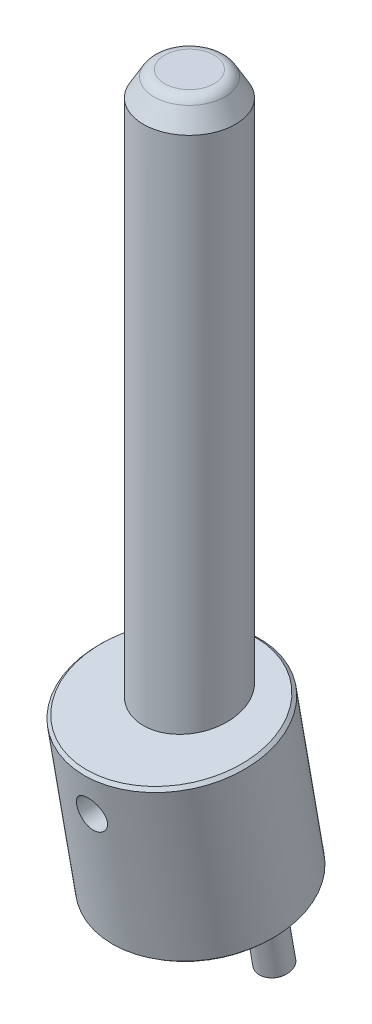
ISO-10303-21;
HEADER;
FILE_DESCRIPTION(('STEP AP214'),'2;1');
FILE_NAME('part.step','',(''),(''),'','','');
FILE_SCHEMA(('AUTOMOTIVE_DESIGN { 1 0 10303 214 1 1 1 1 }'));
ENDSEC;
DATA;
#1=APPLICATION_CONTEXT('core data for automotive mechanical design processes');
#2=APPLICATION_PROTOCOL_DEFINITION('international standard','automotive_design',2000,#1);
#3=PRODUCT_CONTEXT('',#1,'mechanical');
#4=PRODUCT('Part','Part','',(#3));
#5=PRODUCT_RELATED_PRODUCT_CATEGORY('part','',(#4));
#6=PRODUCT_DEFINITION_FORMATION('','',#4);
#7=PRODUCT_DEFINITION_CONTEXT('part definition',#1,'design');
#8=PRODUCT_DEFINITION('design','',#6,#7);
#9=PRODUCT_DEFINITION_SHAPE('','',#8);
#10=(LENGTH_UNIT() NAMED_UNIT(*) SI_UNIT(.MILLI.,.METRE.));
#11=(NAMED_UNIT(*) PLANE_ANGLE_UNIT() SI_UNIT($,.RADIAN.));
#12=(NAMED_UNIT(*) SI_UNIT($,.STERADIAN.) SOLID_ANGLE_UNIT());
#13=UNCERTAINTY_MEASURE_WITH_UNIT(LENGTH_MEASURE(1.E-05),#10,'distance_accuracy_value','');
#14=(GEOMETRIC_REPRESENTATION_CONTEXT(3) GLOBAL_UNCERTAINTY_ASSIGNED_CONTEXT((#13)) GLOBAL_UNIT_ASSIGNED_CONTEXT((#10,
#11,#12)) REPRESENTATION_CONTEXT('',''));
#15=CARTESIAN_POINT('',(0.,0.,0.));
#16=DIRECTION('',(0.,0.,1.));
#17=DIRECTION('',(1.,0.,0.));
#18=AXIS2_PLACEMENT_3D('',#15,#16,#17);
#19=CARTESIAN_POINT('',(0.,-24.9784317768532,-6.24652591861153));
#20=DIRECTION('',(0.,-0.984807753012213,-0.173648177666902));
#21=DIRECTION('',(0.,0.173648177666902,-0.984807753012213));
#22=AXIS2_PLACEMENT_3D('',#19,#20,#21);
#23=PLANE('',#22);
#24=CARTESIAN_POINT('',(-21.5,-24.9784317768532,-6.24652591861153));
#25=DIRECTION('',(0.,-0.984807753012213,-0.173648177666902));
#26=DIRECTION('',(0.,0.173648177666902,-0.984807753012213));
#27=AXIS2_PLACEMENT_3D('',#24,#25,#26);
#28=CIRCLE('',#27,4.50000075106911);
#29=CARTESIAN_POINT('',(-21.5,-24.1970148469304,-10.6781615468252));
#30=VERTEX_POINT('',#29);
#31=EDGE_CURVE('P0_E17',#30,#30,#28,.F.);
#32=ORIENTED_EDGE('',*,*,#31,.F.);
#33=EDGE_LOOP('',(#32));
#34=FACE_BOUND('',#33,.T.);
#35=ADVANCED_FACE('P0_F14',(#34),#23,.T.);
#36=CARTESIAN_POINT('',(0.,-24.9784317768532,-6.24652591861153));
#37=DIRECTION('',(0.,-0.984807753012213,-0.173648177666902));
#38=DIRECTION('',(0.,0.173648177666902,-0.984807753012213));
#39=AXIS2_PLACEMENT_3D('',#36,#37,#38);
#40=PLANE('',#39);
#41=CARTESIAN_POINT('',(21.5,-24.9784317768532,-6.24652591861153));
#42=DIRECTION('',(0.,-0.984807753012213,-0.173648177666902));
#43=DIRECTION('',(0.,0.173648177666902,-0.984807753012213));
#44=AXIS2_PLACEMENT_3D('',#41,#42,#43);
#45=CIRCLE('',#44,4.50000075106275);
#46=CARTESIAN_POINT('',(21.5,-24.1970148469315,-10.6781615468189));
#47=VERTEX_POINT('',#46);
#48=EDGE_CURVE('P0_E121',#47,#47,#45,.F.);
#49=ORIENTED_EDGE('',*,*,#48,.F.);
#50=EDGE_LOOP('',(#49));
#51=FACE_BOUND('',#50,.T.);
#52=ADVANCED_FACE('P0_F111',(#51),#40,.T.);
#53=CARTESIAN_POINT('',(0.,2.47891984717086E-12,-3.4781205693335E-13));
#54=DIRECTION('',(0.,-1.,0.));
#55=DIRECTION('',(0.,0.,-1.));
#56=AXIS2_PLACEMENT_3D('',#53,#54,#55);
#57=PLANE('',#56);
#58=CARTESIAN_POINT('',(0.,2.79984369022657E-12,-2.48629242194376E-12));
#59=DIRECTION('',(0.,-1.,0.));
#60=DIRECTION('',(0.,0.,-1.));
#61=AXIS2_PLACEMENT_3D('',#58,#59,#60);
#62=CIRCLE('',#61,15.);
#63=CARTESIAN_POINT('',(0.,2.79984369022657E-12,-15.0000000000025));
#64=VERTEX_POINT('',#63);
#65=EDGE_CURVE('P0_E36',#64,#64,#62,.F.);
#66=ORIENTED_EDGE('',*,*,#65,.T.);
#67=EDGE_LOOP('',(#66));
#68=FACE_BOUND('',#67,.T.);
#69=ADVANCED_FACE('P0_F108',(#68),#57,.F.);
#70=CARTESIAN_POINT('',(-21.5,-24.4860273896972,-6.15970173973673));
#71=DIRECTION('',(0.,0.984807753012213,0.173648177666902));
#72=DIRECTION('',(0.,-0.173648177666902,0.984807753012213));
#73=AXIS2_PLACEMENT_3D('',#70,#71,#72);
#74=CONICAL_SURFACE('',#73,5.00000135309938,0.785398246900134);
#75=CARTESIAN_POINT('',(-21.5,-24.4860260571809,-6.15970150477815));
#76=DIRECTION('',(0.,-0.984807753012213,-0.173648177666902));
#77=DIRECTION('',(0.,0.173648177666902,-0.984807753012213));
#78=AXIS2_PLACEMENT_3D('',#75,#76,#77);
#79=CIRCLE('',#78,5.);
#80=CARTESIAN_POINT('',(-21.5,-23.6177851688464,-11.0837402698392));
#81=VERTEX_POINT('',#80);
#82=EDGE_CURVE('P0_E33',#81,#81,#79,.F.);
#83=ORIENTED_EDGE('',*,*,#82,.F.);
#84=EDGE_LOOP('',(#83));
#85=FACE_BOUND('',#84,.T.);
#86=ORIENTED_EDGE('',*,*,#31,.T.);
#87=EDGE_LOOP('',(#86));
#88=FACE_BOUND('',#87,.T.);
#89=ADVANCED_FACE('P0_F104',(#85,#88),#74,.T.);
#90=CARTESIAN_POINT('',(21.5,-24.4860273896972,-6.15970173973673));
#91=DIRECTION('',(0.,0.984807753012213,0.173648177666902));
#92=DIRECTION('',(0.,-0.173648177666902,0.984807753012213));
#93=AXIS2_PLACEMENT_3D('',#90,#91,#92);
#94=CONICAL_SURFACE('',#93,5.00000135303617,0.785398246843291);
#95=CARTESIAN_POINT('',(21.5,-24.4860260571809,-6.15970150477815));
#96=DIRECTION('',(0.,-0.984807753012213,-0.173648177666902));
#97=DIRECTION('',(0.,0.173648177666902,-0.984807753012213));
#98=AXIS2_PLACEMENT_3D('',#95,#96,#97);
#99=CIRCLE('',#98,5.);
#100=CARTESIAN_POINT('',(21.5,-23.6177851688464,-11.0837402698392));
#101=VERTEX_POINT('',#100);
#102=EDGE_CURVE('P0_E29',#101,#101,#99,.F.);
#103=ORIENTED_EDGE('',*,*,#102,.F.);
#104=EDGE_LOOP('',(#103));
#105=FACE_BOUND('',#104,.T.);
#106=ORIENTED_EDGE('',*,*,#48,.T.);
#107=EDGE_LOOP('',(#106));
#108=FACE_BOUND('',#107,.T.);
#109=ADVANCED_FACE('P0_F99',(#105,#108),#94,.T.);
#110=CARTESIAN_POINT('',(0.,60.5716661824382,-2.48759346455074E-12));
#111=DIRECTION('',(0.,-1.,0.));
#112=DIRECTION('',(0.,0.,-1.));
#113=AXIS2_PLACEMENT_3D('',#110,#111,#112);
#114=CYLINDRICAL_SURFACE('',#113,15.);
#115=CARTESIAN_POINT('',(0.,45.0000000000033,-2.48759346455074E-12));
#116=DIRECTION('',(0.,0.984807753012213,0.173648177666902));
#117=DIRECTION('',(0.,-0.173648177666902,0.984807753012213));
#118=AXIS2_PLACEMENT_3D('',#115,#116,#117);
#119=ELLIPSE('',#118,15.2313991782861,15.);
#120=CARTESIAN_POINT('',(0.,42.3550952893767,14.9999999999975));
#121=VERTEX_POINT('',#120);
#122=EDGE_CURVE('P0_E32',#121,#121,#119,.F.);
#123=ORIENTED_EDGE('',*,*,#122,.F.);
#124=EDGE_LOOP('',(#123));
#125=FACE_BOUND('',#124,.T.);
#126=ORIENTED_EDGE('',*,*,#65,.F.);
#127=EDGE_LOOP('',(#126));
#128=FACE_BOUND('',#127,.T.);
#129=CARTESIAN_POINT('',(0.,31.0000000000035,14.9999999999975));
#130=CARTESIAN_POINT('',(-0.13627460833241,30.999999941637,14.999999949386));
#131=CARTESIAN_POINT('',(-0.272550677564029,30.9944241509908,14.9981386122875));
#132=CARTESIAN_POINT('',(-0.544142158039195,30.9721706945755,14.9907428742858));
#133=CARTESIAN_POINT('',(-0.679457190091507,30.9554888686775,14.985207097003));
#134=CARTESIAN_POINT('',(-0.948257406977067,30.9111491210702,14.9706027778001));
#135=CARTESIAN_POINT('',(-1.08174007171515,30.8834773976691,14.9615297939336));
#136=CARTESIAN_POINT('',(-1.34580155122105,30.8174009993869,14.9400929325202));
#137=CARTESIAN_POINT('',(-1.47637921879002,30.7789921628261,14.9277277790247));
#138=CARTESIAN_POINT('',(-1.7333461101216,30.6918928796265,14.9000723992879));
#139=CARTESIAN_POINT('',(-1.85974572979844,30.6432305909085,14.8847901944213));
#140=CARTESIAN_POINT('',(-2.10792399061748,30.5359631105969,14.8516789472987));
#141=CARTESIAN_POINT('',(-2.22970089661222,30.4773542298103,14.833848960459));
#142=CARTESIAN_POINT('',(-2.58680471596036,30.2873070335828,14.7772227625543));
#143=CARTESIAN_POINT('',(-2.81420620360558,30.1415453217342,14.7352562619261));
#144=CARTESIAN_POINT('',(-3.24874257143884,29.8108587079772,14.6457020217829));
#145=CARTESIAN_POINT('',(-3.45501840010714,29.6248491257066,14.5979792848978));
#146=CARTESIAN_POINT('',(-3.8341436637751,29.2211801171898,14.5030192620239));
#147=CARTESIAN_POINT('',(-4.0069839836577,29.0035120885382,14.4557821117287));
#148=CARTESIAN_POINT('',(-4.31912807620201,28.5350726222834,14.3656662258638));
#149=CARTESIAN_POINT('',(-4.45732572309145,28.2835298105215,14.3229516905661));
#150=CARTESIAN_POINT('',(-4.68909399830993,27.7591186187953,14.2487652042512));
#151=CARTESIAN_POINT('',(-4.78267844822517,27.4862568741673,14.217289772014));
#152=CARTESIAN_POINT('',(-4.91936749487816,26.9366338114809,14.1705651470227));
#153=CARTESIAN_POINT('',(-4.96406724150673,26.6603139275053,14.1548047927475));
#154=CARTESIAN_POINT('',(-5.00670561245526,26.1036813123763,14.1397828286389));
#155=CARTESIAN_POINT('',(-5.00465868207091,25.8233698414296,14.1405161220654));
#156=CARTESIAN_POINT('',(-4.95509941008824,25.2803173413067,14.1579507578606));
#157=CARTESIAN_POINT('',(-4.90966912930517,25.0173587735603,14.173920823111));
#158=CARTESIAN_POINT('',(-4.77803186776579,24.5030345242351,14.218832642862));
#159=CARTESIAN_POINT('',(-4.69181981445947,24.2516702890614,14.2477760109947));
#160=CARTESIAN_POINT('',(-4.47968995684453,23.7629279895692,14.3158968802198));
#161=CARTESIAN_POINT('',(-4.35315416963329,23.525840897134,14.3552319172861));
#162=CARTESIAN_POINT('',(-4.06444611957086,23.0756402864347,14.4396288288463));
#163=CARTESIAN_POINT('',(-3.90226546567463,22.8625324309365,14.4846920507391));
#164=CARTESIAN_POINT('',(-3.53674216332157,22.4545530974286,14.578364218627));
#165=CARTESIAN_POINT('',(-3.33169626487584,22.2612084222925,14.6270356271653));
#166=CARTESIAN_POINT('',(-3.00176707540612,21.9988448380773,14.6970107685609));
#167=CARTESIAN_POINT('',(-2.88796886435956,21.9159467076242,14.7198467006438));
#168=CARTESIAN_POINT('',(-2.65358317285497,21.759919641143,14.7638979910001));
#169=CARTESIAN_POINT('',(-2.53299841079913,21.6867868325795,14.7851139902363));
#170=CARTESIAN_POINT('',(-2.28442944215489,21.550086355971,14.8255663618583));
#171=CARTESIAN_POINT('',(-2.15637801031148,21.486633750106,14.8447781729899));
#172=CARTESIAN_POINT('',(-1.89503347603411,21.3708247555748,14.8803974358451));
#173=CARTESIAN_POINT('',(-1.76174256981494,21.3184637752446,14.8968060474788));
#174=CARTESIAN_POINT('',(-1.49104566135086,21.2253547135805,14.9263287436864));
#175=CARTESIAN_POINT('',(-1.3536464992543,21.1845884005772,14.9394479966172));
#176=CARTESIAN_POINT('',(-1.0756272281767,21.114966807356,14.9620340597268));
#177=CARTESIAN_POINT('',(-0.935008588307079,21.0861062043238,14.9715025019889));
#178=CARTESIAN_POINT('',(-0.662330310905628,21.0422867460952,14.9859443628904));
#179=CARTESIAN_POINT('',(-0.530427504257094,21.026441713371,14.9912035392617));
#180=CARTESIAN_POINT('',(-0.26568359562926,21.0052983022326,14.9982313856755));
#181=CARTESIAN_POINT('',(-0.132842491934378,20.999999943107,15.0000000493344));
#182=CARTESIAN_POINT('',(0.136274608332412,21.0000000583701,14.999999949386));
#183=CARTESIAN_POINT('',(0.27255067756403,21.0055758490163,14.9981386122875));
#184=CARTESIAN_POINT('',(0.544142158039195,21.0278293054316,14.9907428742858));
#185=CARTESIAN_POINT('',(0.679457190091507,21.0445111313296,14.985207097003));
#186=CARTESIAN_POINT('',(0.948257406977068,21.0888508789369,14.9706027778));
#187=CARTESIAN_POINT('',(1.08174007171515,21.116522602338,14.9615297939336));
#188=CARTESIAN_POINT('',(1.34580155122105,21.1825990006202,14.9400929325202));
#189=CARTESIAN_POINT('',(1.47637921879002,21.221007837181,14.9277277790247));
#190=CARTESIAN_POINT('',(1.7333461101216,21.3081071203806,14.9000723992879));
#191=CARTESIAN_POINT('',(1.85974572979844,21.3567694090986,14.8847901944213));
#192=CARTESIAN_POINT('',(2.10792399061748,21.4640368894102,14.8516789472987));
#193=CARTESIAN_POINT('',(2.22970089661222,21.5226457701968,14.833848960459));
#194=CARTESIAN_POINT('',(2.58680471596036,21.7126929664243,14.7772227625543));
#195=CARTESIAN_POINT('',(2.81420620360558,21.8584546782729,14.7352562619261));
#196=CARTESIAN_POINT('',(3.24874257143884,22.1891412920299,14.6457020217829));
#197=CARTESIAN_POINT('',(3.45501840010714,22.3751508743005,14.5979792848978));
#198=CARTESIAN_POINT('',(3.8341436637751,22.7788198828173,14.5030192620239));
#199=CARTESIAN_POINT('',(4.0069839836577,22.9964879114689,14.4557821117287));
#200=CARTESIAN_POINT('',(4.31912807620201,23.4649273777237,14.3656662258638));
#201=CARTESIAN_POINT('',(4.45732572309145,23.7164701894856,14.3229516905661));
#202=CARTESIAN_POINT('',(4.68909399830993,24.2408813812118,14.2487652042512));
#203=CARTESIAN_POINT('',(4.78267844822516,24.5137431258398,14.217289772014));
#204=CARTESIAN_POINT('',(4.91936749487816,25.0633661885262,14.1705651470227));
#205=CARTESIAN_POINT('',(4.96406724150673,25.3396860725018,14.1548047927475));
#206=CARTESIAN_POINT('',(5.00670561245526,25.8963186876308,14.1397828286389));
#207=CARTESIAN_POINT('',(5.0046586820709,26.1766301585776,14.1405161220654));
#208=CARTESIAN_POINT('',(4.95509941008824,26.7196826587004,14.1579507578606));
#209=CARTESIAN_POINT('',(4.90966912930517,26.9826412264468,14.173920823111));
#210=CARTESIAN_POINT('',(4.77803186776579,27.496965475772,14.218832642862));
#211=CARTESIAN_POINT('',(4.69181981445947,27.7483297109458,14.2477760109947));
#212=CARTESIAN_POINT('',(4.47968995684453,28.2370720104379,14.3158968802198));
#213=CARTESIAN_POINT('',(4.35315416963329,28.4741591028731,14.3552319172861));
#214=CARTESIAN_POINT('',(4.06444611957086,28.9243597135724,14.4396288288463));
#215=CARTESIAN_POINT('',(3.90226546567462,29.1374675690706,14.4846920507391));
#216=CARTESIAN_POINT('',(3.53674216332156,29.5454469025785,14.578364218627));
#217=CARTESIAN_POINT('',(3.33169626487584,29.7387915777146,14.6270356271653));
#218=CARTESIAN_POINT('',(3.00176707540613,30.0011551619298,14.6970107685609));
#219=CARTESIAN_POINT('',(2.88796886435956,30.0840532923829,14.7198467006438));
#220=CARTESIAN_POINT('',(2.65358317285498,30.2400803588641,14.7638979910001));
#221=CARTESIAN_POINT('',(2.53299841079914,30.3132131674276,14.7851139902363));
#222=CARTESIAN_POINT('',(2.2844294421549,30.4499136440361,14.8255663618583));
#223=CARTESIAN_POINT('',(2.15637801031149,30.5133662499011,14.8447781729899));
#224=CARTESIAN_POINT('',(1.89503347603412,30.6291752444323,14.8803974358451));
#225=CARTESIAN_POINT('',(1.76174256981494,30.6815362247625,14.8968060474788));
#226=CARTESIAN_POINT('',(1.49104566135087,30.7746452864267,14.9263287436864));
#227=CARTESIAN_POINT('',(1.3536464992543,30.8154115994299,14.9394479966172));
#228=CARTESIAN_POINT('',(1.0756272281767,30.8850331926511,14.9620340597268));
#229=CARTESIAN_POINT('',(0.935008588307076,30.9138937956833,14.9715025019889));
#230=CARTESIAN_POINT('',(0.662330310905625,30.9577132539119,14.9859443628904));
#231=CARTESIAN_POINT('',(0.530427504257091,30.9735582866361,14.9912035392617));
#232=CARTESIAN_POINT('',(0.265683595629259,30.9947016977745,14.9982313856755));
#233=CARTESIAN_POINT('',(0.132842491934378,31.0000000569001,15.0000000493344));
#234=CARTESIAN_POINT('',(0.,31.0000000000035,14.9999999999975));
#235=B_SPLINE_CURVE_WITH_KNOTS('',3,(#129,#130,#131,#132,#133,#134,#135,#136,#137,#138,#139,
#140,#141,#142,#143,#144,#145,#146,#147,#148,#149,#150,#151,#152,#153,#154,#155,#156,#157,#158,
#159,#160,#161,#162,#163,#164,#165,#166,#167,#168,#169,#170,#171,#172,#173,#174,#175,#176,#177,
#178,#179,#180,#181,#182,#183,#184,#185,#186,#187,#188,#189,#190,#191,#192,#193,#194,#195,#196,
#197,#198,#199,#200,#201,#202,#203,#204,#205,#206,#207,#208,#209,#210,#211,#212,#213,#214,#215,
#216,#217,#218,#219,#220,#221,#222,#223,#224,#225,#226,#227,#228,#229,#230,#231,#232,#233,#234),
.UNSPECIFIED.,.T.,.F.,(4,2,2,2,2,2,2,2,2,2,2,2,2,2,2,2,2,2,2,2,2,2,2,2,2,2,2,2,2,2,2,2,2,2,2,2,
2,2,2,2,2,2,2,2,2,2,2,2,2,2,2,2,4),(0.,0.408700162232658,0.817553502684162,1.22692193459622,
1.6364492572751,2.04486626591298,2.45343508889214,3.26962321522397,4.11140352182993,
4.95341299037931,5.81961254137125,6.68554356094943,7.52228757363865,8.35877302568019,
9.15703078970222,9.95538786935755,10.7666215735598,11.5780464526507,12.4317109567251,
12.8591940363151,13.286507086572,13.7185586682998,14.150431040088,14.5816205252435,
15.0126170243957,15.4110232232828,15.8094301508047,16.2181303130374,16.6269836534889,
17.0363520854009,17.4458794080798,17.8542964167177,18.2628652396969,19.0790533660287,
19.9208336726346,20.762843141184,21.629042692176,22.4949737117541,23.3317177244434,
24.1682031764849,24.9664609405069,25.7648180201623,26.5760517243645,27.3874766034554,
28.2411411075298,28.6686241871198,29.0959372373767,29.5279888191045,29.9598611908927,
30.3910506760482,30.8220471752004,31.2204533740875,31.6188603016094),.UNSPECIFIED.);
#236=CARTESIAN_POINT('',(0.,31.0000000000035,14.9999999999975));
#237=VERTEX_POINT('',#236);
#238=EDGE_CURVE('P0_E84',#237,#237,#235,.T.);
#239=ORIENTED_EDGE('',*,*,#238,.T.);
#240=EDGE_LOOP('',(#239));
#241=FACE_BOUND('',#240,.T.);
#242=ADVANCED_FACE('P0_F93',(#125,#128,#241),#114,.F.);
#243=CARTESIAN_POINT('',(-21.5,-10.20631548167,-3.641803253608));
#244=DIRECTION('',(0.,-0.984807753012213,-0.173648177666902));
#245=DIRECTION('',(0.,0.173648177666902,-0.984807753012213));
#246=AXIS2_PLACEMENT_3D('',#243,#244,#245);
#247=CYLINDRICAL_SURFACE('',#246,5.);
#248=CARTESIAN_POINT('',(-21.5,-10.20631548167,-3.641803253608));
#249=DIRECTION('',(0.,-0.984807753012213,-0.173648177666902));
#250=DIRECTION('',(0.,0.173648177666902,-0.984807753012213));
#251=AXIS2_PLACEMENT_3D('',#248,#249,#250);
#252=CIRCLE('',#251,5.);
#253=CARTESIAN_POINT('',(-21.5,-9.33807459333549,-8.56584201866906));
#254=VERTEX_POINT('',#253);
#255=EDGE_CURVE('P0_E80',#254,#254,#252,.T.);
#256=ORIENTED_EDGE('',*,*,#255,.T.);
#257=EDGE_LOOP('',(#256));
#258=FACE_BOUND('',#257,.T.);
#259=ORIENTED_EDGE('',*,*,#82,.T.);
#260=EDGE_LOOP('',(#259));
#261=FACE_BOUND('',#260,.T.);
#262=ADVANCED_FACE('P0_F98',(#258,#261),#247,.T.);
#263=CARTESIAN_POINT('',(21.5,-10.20631548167,-3.641803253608));
#264=DIRECTION('',(0.,-0.984807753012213,-0.173648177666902));
#265=DIRECTION('',(0.,0.173648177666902,-0.984807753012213));
#266=AXIS2_PLACEMENT_3D('',#263,#264,#265);
#267=CYLINDRICAL_SURFACE('',#266,5.);
#268=CARTESIAN_POINT('',(21.5,-10.20631548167,-3.641803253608));
#269=DIRECTION('',(0.,-0.984807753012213,-0.173648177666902));
#270=DIRECTION('',(0.,0.173648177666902,-0.984807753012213));
#271=AXIS2_PLACEMENT_3D('',#268,#269,#270);
#272=CIRCLE('',#271,5.);
#273=CARTESIAN_POINT('',(21.5,-9.33807459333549,-8.56584201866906));
#274=VERTEX_POINT('',#273);
#275=EDGE_CURVE('P0_E76',#274,#274,#272,.T.);
#276=ORIENTED_EDGE('',*,*,#275,.T.);
#277=EDGE_LOOP('',(#276));
#278=FACE_BOUND('',#277,.T.);
#279=ORIENTED_EDGE('',*,*,#102,.T.);
#280=EDGE_LOOP('',(#279));
#281=FACE_BOUND('',#280,.T.);
#282=ADVANCED_FACE('P0_F178',(#278,#281),#267,.T.);
#283=CARTESIAN_POINT('',(0.,43.9581109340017,5.90884651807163));
#284=DIRECTION('',(0.,0.984807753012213,0.173648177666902));
#285=DIRECTION('',(0.,-0.173648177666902,0.984807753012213));
#286=AXIS2_PLACEMENT_3D('',#283,#284,#285);
#287=PLANE('',#286);
#288=ORIENTED_EDGE('',*,*,#122,.T.);
#289=EDGE_LOOP('',(#288));
#290=FACE_BOUND('',#289,.T.);
#291=CARTESIAN_POINT('',(0.,43.9581109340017,5.9088465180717));
#292=DIRECTION('',(0.,0.984807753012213,0.173648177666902));
#293=DIRECTION('',(0.,-0.173648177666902,0.984807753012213));
#294=AXIS2_PLACEMENT_3D('',#291,#292,#293);
#295=CIRCLE('',#294,27.9999945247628);
#296=CARTESIAN_POINT('',(0.,39.0959629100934,33.4834582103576));
#297=VERTEX_POINT('',#296);
#298=EDGE_CURVE('P0_E46',#297,#297,#295,.F.);
#299=ORIENTED_EDGE('',*,*,#298,.F.);
#300=EDGE_LOOP('',(#299));
#301=FACE_BOUND('',#300,.T.);
#302=ADVANCED_FACE('P0_F71',(#290,#301),#287,.T.);
#303=CARTESIAN_POINT('',(0.,26.0000000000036,-5.5138031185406));
#304=DIRECTION('',(0.,0.,1.));
#305=DIRECTION('',(0.,-1.,0.));
#306=AXIS2_PLACEMENT_3D('',#303,#304,#305);
#307=CYLINDRICAL_SURFACE('',#306,5.);
#308=ORIENTED_EDGE('',*,*,#238,.F.);
#309=EDGE_LOOP('',(#308));
#310=FACE_BOUND('',#309,.T.);
#311=CARTESIAN_POINT('',(0.,21.0000000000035,31.3080838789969));
#312=CARTESIAN_POINT('',(-0.140354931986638,21.0000005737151,31.3080837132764));
#313=CARTESIAN_POINT('',(-0.280725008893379,21.0059142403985,31.3080894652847));
#314=CARTESIAN_POINT('',(-0.560523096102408,21.0295335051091,31.308133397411));
#315=CARTESIAN_POINT('',(-0.69995066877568,21.0472442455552,31.3081715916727));
#316=CARTESIAN_POINT('',(-0.97703493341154,21.0943725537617,31.3083440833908));
#317=CARTESIAN_POINT('',(-1.1146885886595,21.1238079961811,31.3084785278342));
#318=CARTESIAN_POINT('',(-1.38707525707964,21.1941892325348,31.3089475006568));
#319=CARTESIAN_POINT('',(-1.52180715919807,21.2351393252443,31.3092821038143));
#320=CARTESIAN_POINT('',(-1.78719418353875,21.3282028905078,31.3102916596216));
#321=CARTESIAN_POINT('',(-1.91785354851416,21.3803042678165,31.3109662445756));
#322=CARTESIAN_POINT('',(-2.17436447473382,21.4953463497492,31.3128281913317));
#323=CARTESIAN_POINT('',(-2.30021424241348,21.5582910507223,31.3140157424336));
#324=CARTESIAN_POINT('',(-2.54605968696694,21.6945020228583,31.3171010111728));
#325=CARTESIAN_POINT('',(-2.66605989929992,21.7677601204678,31.3189981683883));
#326=CARTESIAN_POINT('',(-2.89949840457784,21.9241377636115,31.3237207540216));
#327=CARTESIAN_POINT('',(-3.01293426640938,22.0072609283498,31.3265465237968));
#328=CARTESIAN_POINT('',(-3.23222119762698,22.1826153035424,31.3333495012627));
#329=CARTESIAN_POINT('',(-3.33808323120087,22.2748328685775,31.3373250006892));
#330=CARTESIAN_POINT('',(-3.54168749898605,22.4678429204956,31.3466603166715));
#331=CARTESIAN_POINT('',(-3.63942671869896,22.5686385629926,31.3520206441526));
#332=CARTESIAN_POINT('',(-3.82601073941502,22.7779981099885,31.3643452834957));
#333=CARTESIAN_POINT('',(-3.91485858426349,22.8865593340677,31.3713090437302));
#334=CARTESIAN_POINT('',(-4.08309789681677,23.1107169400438,31.3870496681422));
#335=CARTESIAN_POINT('',(-4.1624858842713,23.2263158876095,31.3958271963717));
#336=CARTESIAN_POINT('',(-4.31079436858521,23.4629852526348,31.4153180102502));
#337=CARTESIAN_POINT('',(-4.37977090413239,23.5840214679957,31.4260201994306));
#338=CARTESIAN_POINT('',(-4.50734130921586,23.8313044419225,31.4495370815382));
#339=CARTESIAN_POINT('',(-4.56593136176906,23.9575530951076,31.4623525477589));
#340=CARTESIAN_POINT('',(-4.67229502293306,24.2142393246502,31.4901881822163));
#341=CARTESIAN_POINT('',(-4.72007314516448,24.3446751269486,31.5052074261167));
#342=CARTESIAN_POINT('',(-4.80457028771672,24.6088240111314,31.5374990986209));
#343=CARTESIAN_POINT('',(-4.84128520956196,24.7425382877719,31.5547723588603));
#344=CARTESIAN_POINT('',(-4.9344018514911,25.1468196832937,31.6099488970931));
#345=CARTESIAN_POINT('',(-4.97397498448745,25.4210095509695,31.6512604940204));
#346=CARTESIAN_POINT('',(-5.00750238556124,25.9706241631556,31.7422229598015));
#347=CARTESIAN_POINT('',(-5.00145259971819,26.24604901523,31.7918745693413));
#348=CARTESIAN_POINT('',(-4.94414664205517,26.7956211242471,31.8989076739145));
#349=CARTESIAN_POINT('',(-4.89211286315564,27.0696644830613,31.9564076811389));
#350=CARTESIAN_POINT('',(-4.74372153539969,27.6044139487,32.0760821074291));
#351=CARTESIAN_POINT('',(-4.64735533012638,27.8651174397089,32.138257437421));
#352=CARTESIAN_POINT('',(-4.40964293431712,28.3740866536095,32.2661774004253));
#353=CARTESIAN_POINT('',(-4.26705267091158,28.6217578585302,32.3319732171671));
#354=CARTESIAN_POINT('',(-3.94143600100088,29.0896967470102,32.4617479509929));
#355=CARTESIAN_POINT('',(-3.75840730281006,29.3099628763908,32.5257267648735));
#356=CARTESIAN_POINT('',(-3.45620879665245,29.6160125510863,32.6176239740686));
#357=CARTESIAN_POINT('',(-3.35020903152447,29.714441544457,32.647731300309));
#358=CARTESIAN_POINT('',(-3.12977546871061,29.9019749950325,32.7059630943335));
#359=CARTESIAN_POINT('',(-3.0153450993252,29.991083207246,32.7340883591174));
#360=CARTESIAN_POINT('',(-2.77869820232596,30.1593193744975,32.7878790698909));
#361=CARTESIAN_POINT('',(-2.65647588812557,30.2384397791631,32.8135426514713));
#362=CARTESIAN_POINT('',(-2.40520446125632,30.3859090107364,32.861897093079));
#363=CARTESIAN_POINT('',(-2.27615845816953,30.4542626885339,32.8845892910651));
#364=CARTESIAN_POINT('',(-2.01626980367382,30.5776297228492,32.925907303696));
#365=CARTESIAN_POINT('',(-1.88561064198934,30.6329944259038,32.9446383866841));
#366=CARTESIAN_POINT('',(-1.61970463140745,30.732514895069,32.9785342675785));
#367=CARTESIAN_POINT('',(-1.48445990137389,30.7766757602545,32.9937006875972));
#368=CARTESIAN_POINT('',(-1.21062826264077,30.8533034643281,33.0201453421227));
#369=CARTESIAN_POINT('',(-1.07204874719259,30.8857940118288,33.0314314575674));
#370=CARTESIAN_POINT('',(-0.792421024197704,30.9388562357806,33.0499192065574));
#371=CARTESIAN_POINT('',(-0.651374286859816,30.9594347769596,33.0571231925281));
#372=CARTESIAN_POINT('',(-0.425043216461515,30.9826278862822,33.0652531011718));
#373=CARTESIAN_POINT('',(-0.340186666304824,30.9891396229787,33.067539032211));
#374=CARTESIAN_POINT('',(-0.170223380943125,30.9978259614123,33.0705894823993));
#375=CARTESIAN_POINT('',(-0.0851166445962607,31.0000005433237,33.0713539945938));
#376=CARTESIAN_POINT('',(0.135219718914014,30.9999991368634,33.0713531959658));
#377=CARTESIAN_POINT('',(0.270464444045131,30.9945087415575,33.069422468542));
#378=CARTESIAN_POINT('',(0.540009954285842,30.972593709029,33.0617338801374));
#379=CARTESIAN_POINT('',(0.674310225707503,30.9561635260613,33.0559740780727));
#380=CARTESIAN_POINT('',(0.941162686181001,30.9124861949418,33.040723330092));
#381=CARTESIAN_POINT('',(1.07371151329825,30.8852206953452,33.0312260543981));
#382=CARTESIAN_POINT('',(1.33592795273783,30.8201199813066,33.0086759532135));
#383=CARTESIAN_POINT('',(1.46559441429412,30.7822806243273,32.9956217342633));
#384=CARTESIAN_POINT('',(1.72075531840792,30.6964943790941,32.9662378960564));
#385=CARTESIAN_POINT('',(1.84626038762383,30.6485759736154,32.9499175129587));
#386=CARTESIAN_POINT('',(2.09267219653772,30.5429859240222,32.9142684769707));
#387=CARTESIAN_POINT('',(2.21357721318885,30.4853106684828,32.8949387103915));
#388=CARTESIAN_POINT('',(2.5680548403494,30.2984045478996,32.8329409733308));
#389=CARTESIAN_POINT('',(2.79373594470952,30.1551761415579,32.7862235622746));
#390=CARTESIAN_POINT('',(3.22468958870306,29.8309759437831,32.6834595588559));
#391=CARTESIAN_POINT('',(3.4291385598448,29.6489937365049,32.6271735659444));
#392=CARTESIAN_POINT('',(3.80514153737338,29.2550044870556,32.5097073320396));
#393=CARTESIAN_POINT('',(3.9766852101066,29.0429880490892,32.448525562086));
#394=CARTESIAN_POINT('',(4.290166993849,28.583673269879,32.3217414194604));
#395=CARTESIAN_POINT('',(4.43033462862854,28.3351849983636,32.2560664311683));
#396=CARTESIAN_POINT('',(4.66662569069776,27.8175626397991,32.126693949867));
#397=CARTESIAN_POINT('',(4.7627448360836,27.5484265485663,32.0629966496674));
#398=CARTESIAN_POINT('',(4.90883098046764,26.9933510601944,31.9400388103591));
#399=CARTESIAN_POINT('',(4.95823701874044,26.7072502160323,31.8808398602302));
#400=CARTESIAN_POINT('',(5.00672423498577,26.1291392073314,31.7703203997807));
#401=CARTESIAN_POINT('',(5.0058132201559,25.8371299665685,31.7189986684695));
#402=CARTESIAN_POINT('',(4.9665482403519,25.405230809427,31.6497846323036));
#403=CARTESIAN_POINT('',(4.94758189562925,25.2639201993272,31.6282192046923));
#404=CARTESIAN_POINT('',(4.89757632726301,24.9831224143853,31.5874543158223));
#405=CARTESIAN_POINT('',(4.86654205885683,24.8436345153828,31.5682538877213));
#406=CARTESIAN_POINT('',(4.7925384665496,24.5675117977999,31.5322571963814));
#407=CARTESIAN_POINT('',(4.74956581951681,24.4308777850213,31.5154616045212));
#408=CARTESIAN_POINT('',(4.65196992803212,24.1616120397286,31.4842619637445));
#409=CARTESIAN_POINT('',(4.59735134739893,24.028978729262,31.4698569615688));
#410=CARTESIAN_POINT('',(4.47836930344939,23.7720561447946,31.4436921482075));
#411=CARTESIAN_POINT('',(4.41429231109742,23.6476400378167,31.4318738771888));
#412=CARTESIAN_POINT('',(4.2758737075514,23.4045306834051,31.4103066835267));
#413=CARTESIAN_POINT('',(4.20153612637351,23.2858352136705,31.4005569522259));
#414=CARTESIAN_POINT('',(4.04307170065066,23.0549738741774,31.3829574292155));
#415=CARTESIAN_POINT('',(3.9589422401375,22.9428097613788,31.3751081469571));
#416=CARTESIAN_POINT('',(3.78153658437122,22.7259196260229,31.3611225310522));
#417=CARTESIAN_POINT('',(3.68826376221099,22.6211908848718,31.3549855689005));
#418=CARTESIAN_POINT('',(3.49382094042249,22.4205291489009,31.3442399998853));
#419=CARTESIAN_POINT('',(3.39270402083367,22.3245452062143,31.3396220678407));
#420=CARTESIAN_POINT('',(3.18282015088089,22.1413668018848,31.3316411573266));
#421=CARTESIAN_POINT('',(3.0740560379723,22.0541691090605,31.3282777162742));
#422=CARTESIAN_POINT('',(2.84952119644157,21.8890801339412,31.3225763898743));
#423=CARTESIAN_POINT('',(2.73374492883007,21.8111963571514,31.3202393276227));
#424=CARTESIAN_POINT('',(2.49612317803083,21.6653958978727,31.3163764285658));
#425=CARTESIAN_POINT('',(2.37427989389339,21.5974756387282,31.3148503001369));
#426=CARTESIAN_POINT('',(2.12458452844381,21.4716666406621,31.3123962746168));
#427=CARTESIAN_POINT('',(1.99670044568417,21.4138413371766,31.311472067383));
#428=CARTESIAN_POINT('',(1.73657081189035,21.3091609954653,31.3100511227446));
#429=CARTESIAN_POINT('',(1.60432688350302,21.2623019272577,31.3095542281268));
#430=CARTESIAN_POINT('',(1.33657346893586,21.1799208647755,31.3088309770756));
#431=CARTESIAN_POINT('',(1.20106920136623,21.1443819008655,31.3086042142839));
#432=CARTESIAN_POINT('',(0.927608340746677,21.0848079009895,31.3082972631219));
#433=CARTESIAN_POINT('',(0.789652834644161,21.0607678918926,31.3082170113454));
#434=CARTESIAN_POINT('',(0.543067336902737,21.0283884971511,31.3081298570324));
#435=CARTESIAN_POINT('',(0.434733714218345,21.0177471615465,31.3081106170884));
#436=CARTESIAN_POINT('',(0.217603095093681,21.0035526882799,31.3080876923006));
#437=CARTESIAN_POINT('',(0.108806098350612,20.9999995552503,31.3080840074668));
#438=CARTESIAN_POINT('',(0.,21.0000000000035,31.3080838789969));
#439=B_SPLINE_CURVE_WITH_KNOTS('',3,(#311,#312,#313,#314,#315,#316,#317,#318,#319,#320,#321,
#322,#323,#324,#325,#326,#327,#328,#329,#330,#331,#332,#333,#334,#335,#336,#337,#338,#339,#340,
#341,#342,#343,#344,#345,#346,#347,#348,#349,#350,#351,#352,#353,#354,#355,#356,#357,#358,#359,
#360,#361,#362,#363,#364,#365,#366,#367,#368,#369,#370,#371,#372,#373,#374,#375,#376,#377,#378,
#379,#380,#381,#382,#383,#384,#385,#386,#387,#388,#389,#390,#391,#392,#393,#394,#395,#396,#397,
#398,#399,#400,#401,#402,#403,#404,#405,#406,#407,#408,#409,#410,#411,#412,#413,#414,#415,#416,
#417,#418,#419,#420,#421,#422,#423,#424,#425,#426,#427,#428,#429,#430,#431,#432,#433,#434,#435,
#436,#437,#438),.UNSPECIFIED.,.T.,.F.,(4,2,2,2,2,2,2,2,2,2,2,2,2,2,2,2,2,2,2,2,2,2,2,2,2,2,2,2,
2,2,2,2,2,2,2,2,2,2,2,2,2,2,2,2,2,2,2,2,2,2,2,2,2,2,2,2,2,2,2,2,2,2,2,4),(0.,0.420966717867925,
0.84211705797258,1.26391192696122,1.68586447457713,2.1073616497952,2.52901450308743,
2.95033505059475,3.37181064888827,3.79266320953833,4.21367126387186,4.63453469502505,
5.05555248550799,5.47421651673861,5.89303408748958,6.31167649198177,6.73047379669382,
7.56650953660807,8.40261956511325,9.25314500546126,10.1038365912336,10.9796457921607,
11.8555046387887,12.2983095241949,12.7409353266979,13.1838937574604,13.626652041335,
14.0555148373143,14.4841820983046,14.9119735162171,15.3395181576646,15.5948156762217,
15.8501143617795,16.2556921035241,16.6614756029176,17.0679493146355,17.4745824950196,
17.8800816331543,18.2857311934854,19.0959410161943,19.9306524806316,20.765625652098,
21.6398439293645,22.5141471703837,23.3988210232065,24.283357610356,24.7155182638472,
25.1475016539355,25.5796054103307,26.0115364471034,26.4323684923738,26.8530357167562,
27.2738155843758,27.6944408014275,28.1124334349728,28.5302717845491,28.9484446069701,
29.3664669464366,29.7870282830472,30.2074348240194,30.6272081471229,31.0467997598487,
31.3731418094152,31.6994840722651),.UNSPECIFIED.);
#440=CARTESIAN_POINT('',(0.,21.0000000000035,31.3080838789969));
#441=VERTEX_POINT('',#440);
#442=EDGE_CURVE('P0_E39',#441,#441,#439,.T.);
#443=ORIENTED_EDGE('',*,*,#442,.F.);
#444=EDGE_LOOP('',(#443));
#445=FACE_BOUND('',#444,.T.);
#446=ADVANCED_FACE('P0_F48',(#310,#445),#307,.F.);
#447=CARTESIAN_POINT('',(0.,-10.20631548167,-3.641803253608));
#448=DIRECTION('',(0.,0.984807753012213,0.173648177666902));
#449=DIRECTION('',(0.,-0.173648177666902,0.984807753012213));
#450=AXIS2_PLACEMENT_3D('',#447,#448,#449);
#451=PLANE('',#450);
#452=ORIENTED_EDGE('',*,*,#275,.F.);
#453=EDGE_LOOP('',(#452));
#454=FACE_BOUND('',#453,.T.);
#455=ORIENTED_EDGE('',*,*,#255,.F.);
#456=EDGE_LOOP('',(#455));
#457=FACE_BOUND('',#456,.T.);
#458=CARTESIAN_POINT('',(-1.28369537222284E-13,-10.20631548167,-3.64180325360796));
#459=DIRECTION('',(0.,0.984807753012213,0.173648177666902));
#460=DIRECTION('',(0.,-0.173648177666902,0.984807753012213));
#461=AXIS2_PLACEMENT_3D('',#458,#459,#460);
#462=CIRCLE('',#461,27.9999942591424);
#463=CARTESIAN_POINT('',(-1.28369537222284E-13,-15.0684634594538,23.9328081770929));
#464=VERTEX_POINT('',#463);
#465=EDGE_CURVE('P0_E26',#464,#464,#462,.T.);
#466=ORIENTED_EDGE('',*,*,#465,.F.);
#467=EDGE_LOOP('',(#466));
#468=FACE_BOUND('',#467,.T.);
#469=ADVANCED_FACE('P0_F63',(#454,#457,#468),#451,.F.);
#470=CARTESIAN_POINT('',(0.,42.9733002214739,5.73519781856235));
#471=DIRECTION('',(0.,-0.984807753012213,-0.173648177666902));
#472=DIRECTION('',(0.,0.173648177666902,-0.984807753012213));
#473=AXIS2_PLACEMENT_3D('',#470,#471,#472);
#474=CONICAL_SURFACE('',#473,28.9999973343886,0.785398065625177);
#475=ORIENTED_EDGE('',*,*,#298,.T.);
#476=EDGE_LOOP('',(#475));
#477=FACE_BOUND('',#476,.T.);
#478=CARTESIAN_POINT('',(0.,42.9733028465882,5.73519828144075));
#479=DIRECTION('',(0.,0.984807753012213,0.173648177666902));
#480=DIRECTION('',(0.,-0.173648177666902,0.984807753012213));
#481=AXIS2_PLACEMENT_3D('',#478,#479,#480);
#482=CIRCLE('',#481,29.);
#483=CARTESIAN_POINT('',(0.,37.937505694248,34.2946231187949));
#484=VERTEX_POINT('',#483);
#485=EDGE_CURVE('P0_E21',#484,#484,#482,.F.);
#486=ORIENTED_EDGE('',*,*,#485,.F.);
#487=EDGE_LOOP('',(#486));
#488=FACE_BOUND('',#487,.T.);
#489=ADVANCED_FACE('P0_F60',(#477,#488),#474,.T.);
#490=CARTESIAN_POINT('',(-1.28369537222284E-13,-9.22150459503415,-3.46815452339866));
#491=DIRECTION('',(0.,0.984807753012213,0.173648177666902));
#492=DIRECTION('',(0.,-0.173648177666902,0.984807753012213));
#493=AXIS2_PLACEMENT_3D('',#490,#491,#492);
#494=CONICAL_SURFACE('',#493,28.9999972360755,0.785398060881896);
#495=CARTESIAN_POINT('',(0.,-9.22150731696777,-3.46815500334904));
#496=DIRECTION('',(0.,0.984807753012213,0.173648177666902));
#497=DIRECTION('',(0.,-0.173648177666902,0.984807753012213));
#498=AXIS2_PLACEMENT_3D('',#495,#496,#497);
#499=CIRCLE('',#498,29.);
#500=CARTESIAN_POINT('',(0.,-14.2573044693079,25.0912698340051));
#501=VERTEX_POINT('',#500);
#502=EDGE_CURVE('P0_E9',#501,#501,#499,.T.);
#503=ORIENTED_EDGE('',*,*,#502,.F.);
#504=EDGE_LOOP('',(#503));
#505=FACE_BOUND('',#504,.T.);
#506=ORIENTED_EDGE('',*,*,#465,.T.);
#507=EDGE_LOOP('',(#506));
#508=FACE_BOUND('',#507,.T.);
#509=ADVANCED_FACE('P0_F56',(#505,#508),#494,.T.);
#510=CARTESIAN_POINT('',(0.,-12.9145368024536,-4.11933574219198));
#511=DIRECTION('',(0.,0.984807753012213,0.173648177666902));
#512=DIRECTION('',(0.,-0.173648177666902,0.984807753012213));
#513=AXIS2_PLACEMENT_3D('',#510,#511,#512);
#514=CYLINDRICAL_SURFACE('',#513,29.);
#515=ORIENTED_EDGE('',*,*,#485,.T.);
#516=EDGE_LOOP('',(#515));
#517=FACE_BOUND('',#516,.T.);
#518=ORIENTED_EDGE('',*,*,#502,.T.);
#519=EDGE_LOOP('',(#518));
#520=FACE_BOUND('',#519,.T.);
#521=ORIENTED_EDGE('',*,*,#442,.T.);
#522=EDGE_LOOP('',(#521));
#523=FACE_BOUND('',#522,.T.);
#524=ADVANCED_FACE('P0_F52',(#517,#520,#523),#514,.T.);
#525=CLOSED_SHELL('',(#35,#52,#69,#89,#109,#242,#262,#282,#302,#446,#469,#489,#509,#524));
#526=MANIFOLD_SOLID_BREP('P0_B1',#525);
#527=CARTESIAN_POINT('',(0.,220.,0.));
#528=DIRECTION('',(0.,1.,0.));
#529=DIRECTION('',(-1.,0.,0.));
#530=AXIS2_PLACEMENT_3D('',#527,#528,#529);
#531=PLANE('',#530);
#532=CARTESIAN_POINT('',(0.,220.,0.));
#533=DIRECTION('',(0.,-1.,0.));
#534=DIRECTION('',(0.,0.,-1.));
#535=AXIS2_PLACEMENT_3D('',#532,#533,#534);
#536=CIRCLE('',#535,8.071796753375);
#537=CARTESIAN_POINT('',(0.,220.,-8.0717967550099));
#538=VERTEX_POINT('',#537);
#539=CARTESIAN_POINT('',(0.,220.,8.0717967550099));
#540=VERTEX_POINT('',#539);
#541=EDGE_CURVE('P1_E38',#538,#540,#536,.T.);
#542=ORIENTED_EDGE('',*,*,#541,.F.);
#543=CARTESIAN_POINT('',(0.,220.,0.));
#544=DIRECTION('',(0.,-1.,0.));
#545=DIRECTION('',(0.,0.,1.));
#546=AXIS2_PLACEMENT_3D('',#543,#544,#545);
#547=CIRCLE('',#546,8.071796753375);
#548=EDGE_CURVE('P1_E42',#540,#538,#547,.T.);
#549=ORIENTED_EDGE('',*,*,#548,.F.);
#550=EDGE_LOOP('',(#542,#549));
#551=FACE_BOUND('',#550,.T.);
#552=ADVANCED_FACE('P1_F17',(#551),#531,.T.);
#553=CARTESIAN_POINT('',(0.,216.,0.));
#554=DIRECTION('',(0.,1.,0.));
#555=DIRECTION('',(0.0058252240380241,0.,0.999983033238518));
#556=AXIS2_PLACEMENT_3D('',#553,#554,#555);
#557=TOROIDAL_SURFACE('',#556,8.071796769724,4.);
#558=ORIENTED_EDGE('',*,*,#541,.T.);
#559=ORIENTED_EDGE('',*,*,#548,.T.);
#560=EDGE_LOOP('',(#558,#559));
#561=FACE_BOUND('',#560,.T.);
#562=CARTESIAN_POINT('',(0.,218.000000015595,0.));
#563=DIRECTION('',(0.,-1.,0.));
#564=DIRECTION('',(0.,0.,1.));
#565=AXIS2_PLACEMENT_3D('',#562,#563,#564);
#566=CIRCLE('',#565,11.5358983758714);
#567=CARTESIAN_POINT('',(0.,218.000000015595,11.5358983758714));
#568=VERTEX_POINT('',#567);
#569=EDGE_CURVE('P1_E48',#568,#568,#566,.T.);
#570=ORIENTED_EDGE('',*,*,#569,.F.);
#571=EDGE_LOOP('',(#570));
#572=FACE_BOUND('',#571,.T.);
#573=ADVANCED_FACE('P1_F40',(#561,#572),#557,.T.);
#574=CARTESIAN_POINT('',(0.,0.,0.));
#575=DIRECTION('',(0.,1.,0.));
#576=DIRECTION('',(-1.,0.,0.));
#577=AXIS2_PLACEMENT_3D('',#574,#575,#576);
#578=PLANE('',#577);
#579=CARTESIAN_POINT('',(0.,0.,0.));
#580=DIRECTION('',(0.,1.,0.));
#581=DIRECTION('',(-1.,0.,0.));
#582=AXIS2_PLACEMENT_3D('',#579,#580,#581);
#583=CIRCLE('',#582,13.9999969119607);
#584=CARTESIAN_POINT('',(-13.9999969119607,0.,0.));
#585=VERTEX_POINT('',#584);
#586=EDGE_CURVE('P1_E85',#585,#585,#583,.T.);
#587=ORIENTED_EDGE('',*,*,#586,.F.);
#588=EDGE_LOOP('',(#587));
#589=FACE_BOUND('',#588,.T.);
#590=ADVANCED_FACE('P1_F76',(#589),#578,.F.);
#591=CARTESIAN_POINT('',(0.,26.,4.88675134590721));
#592=DIRECTION('',(0.,0.,1.));
#593=DIRECTION('',(0.,-1.,0.));
#594=AXIS2_PLACEMENT_3D('',#591,#592,#593);
#595=CONICAL_SURFACE('',#594,4.99999999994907,1.04719755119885);
#596=CARTESIAN_POINT('',(0.,26.0000000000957,1.99999999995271));
#597=VERTEX_POINT('',#596);
#598=VERTEX_LOOP('',#597);
#599=FACE_BOUND('',#598,.T.);
#600=CARTESIAN_POINT('',(0.,26.,4.886751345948));
#601=DIRECTION('',(0.,0.,1.));
#602=DIRECTION('',(0.,-1.,0.));
#603=AXIS2_PLACEMENT_3D('',#600,#601,#602);
#604=CIRCLE('',#603,5.);
#605=CARTESIAN_POINT('',(0.,21.,4.886751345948));
#606=VERTEX_POINT('',#605);
#607=EDGE_CURVE('P1_E82',#606,#606,#604,.T.);
#608=ORIENTED_EDGE('',*,*,#607,.T.);
#609=EDGE_LOOP('',(#608));
#610=FACE_BOUND('',#609,.T.);
#611=ADVANCED_FACE('P1_F116',(#599,#610),#595,.F.);
#612=CARTESIAN_POINT('',(0.,212.000000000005,0.));
#613=DIRECTION('',(0.,-1.,0.));
#614=DIRECTION('',(1.,0.,0.));
#615=AXIS2_PLACEMENT_3D('',#612,#613,#614);
#616=CONICAL_SURFACE('',#615,15.0000000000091,0.5235987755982);
#617=CARTESIAN_POINT('',(0.,212.,0.));
#618=DIRECTION('',(0.,1.,0.));
#619=DIRECTION('',(-1.,0.,0.));
#620=AXIS2_PLACEMENT_3D('',#617,#618,#619);
#621=CIRCLE('',#620,15.);
#622=CARTESIAN_POINT('',(-15.,212.,0.));
#623=VERTEX_POINT('',#622);
#624=EDGE_CURVE('P1_E92',#623,#623,#621,.F.);
#625=ORIENTED_EDGE('',*,*,#624,.F.);
#626=EDGE_LOOP('',(#625));
#627=FACE_BOUND('',#626,.T.);
#628=ORIENTED_EDGE('',*,*,#569,.T.);
#629=EDGE_LOOP('',(#628));
#630=FACE_BOUND('',#629,.T.);
#631=ADVANCED_FACE('P1_F108',(#627,#630),#616,.T.);
#632=CARTESIAN_POINT('',(0.,1.00000179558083,0.));
#633=DIRECTION('',(0.,1.,0.));
#634=DIRECTION('',(-1.,0.,0.));
#635=AXIS2_PLACEMENT_3D('',#632,#633,#634);
#636=CONICAL_SURFACE('',#635,14.9999984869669,0.785398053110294);
#637=CARTESIAN_POINT('',(0.,1.000000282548,0.));
#638=DIRECTION('',(0.,1.,0.));
#639=DIRECTION('',(-1.,0.,0.));
#640=AXIS2_PLACEMENT_3D('',#637,#638,#639);
#641=CIRCLE('',#640,15.);
#642=CARTESIAN_POINT('',(-15.,1.000000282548,0.));
#643=VERTEX_POINT('',#642);
#644=EDGE_CURVE('P1_E28',#643,#643,#641,.T.);
#645=ORIENTED_EDGE('',*,*,#644,.F.);
#646=EDGE_LOOP('',(#645));
#647=FACE_BOUND('',#646,.T.);
#648=ORIENTED_EDGE('',*,*,#586,.T.);
#649=EDGE_LOOP('',(#648));
#650=FACE_BOUND('',#649,.T.);
#651=ADVANCED_FACE('P1_F105',(#647,#650),#636,.T.);
#652=CARTESIAN_POINT('',(0.,26.,1.25));
#653=DIRECTION('',(0.,0.,1.));
#654=DIRECTION('',(0.,-1.,0.));
#655=AXIS2_PLACEMENT_3D('',#652,#653,#654);
#656=CYLINDRICAL_SURFACE('',#655,5.);
#657=ORIENTED_EDGE('',*,*,#607,.F.);
#658=EDGE_LOOP('',(#657));
#659=FACE_BOUND('',#658,.T.);
#660=CARTESIAN_POINT('',(0.,21.,15.));
#661=CARTESIAN_POINT('',(-0.136274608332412,21.0000000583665,14.9999999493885));
#662=CARTESIAN_POINT('',(-0.272550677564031,21.0055758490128,14.99813861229));
#663=CARTESIAN_POINT('',(-0.544142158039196,21.0278293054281,14.9907428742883));
#664=CARTESIAN_POINT('',(-0.679457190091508,21.044511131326,14.9852070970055));
#665=CARTESIAN_POINT('',(-0.948257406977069,21.0888508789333,14.9706027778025));
#666=CARTESIAN_POINT('',(-1.08174007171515,21.1165226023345,14.9615297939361));
#667=CARTESIAN_POINT('',(-1.34580155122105,21.1825990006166,14.9400929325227));
#668=CARTESIAN_POINT('',(-1.47637921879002,21.2210078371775,14.9277277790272));
#669=CARTESIAN_POINT('',(-1.7333461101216,21.308107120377,14.9000723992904));
#670=CARTESIAN_POINT('',(-1.85974572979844,21.356769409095,14.8847901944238));
#671=CARTESIAN_POINT('',(-2.10792399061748,21.4640368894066,14.8516789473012));
#672=CARTESIAN_POINT('',(-2.22970089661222,21.5226457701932,14.8338489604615));
#673=CARTESIAN_POINT('',(-2.58680471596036,21.7126929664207,14.7772227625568));
#674=CARTESIAN_POINT('',(-2.81420620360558,21.8584546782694,14.7352562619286));
#675=CARTESIAN_POINT('',(-3.24874257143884,22.1891412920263,14.6457020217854));
#676=CARTESIAN_POINT('',(-3.45501840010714,22.3751508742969,14.5979792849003));
#677=CARTESIAN_POINT('',(-3.8341436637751,22.7788198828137,14.5030192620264));
#678=CARTESIAN_POINT('',(-4.0069839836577,22.9964879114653,14.4557821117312));
#679=CARTESIAN_POINT('',(-4.31912807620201,23.4649273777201,14.3656662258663));
#680=CARTESIAN_POINT('',(-4.45732572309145,23.716470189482,14.3229516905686));
#681=CARTESIAN_POINT('',(-4.68909399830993,24.2408813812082,14.2487652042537));
#682=CARTESIAN_POINT('',(-4.78267844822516,24.5137431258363,14.2172897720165));
#683=CARTESIAN_POINT('',(-4.91936749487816,25.0633661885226,14.1705651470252));
#684=CARTESIAN_POINT('',(-4.96406724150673,25.3396860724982,14.15480479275));
#685=CARTESIAN_POINT('',(-5.00670561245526,25.8963186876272,14.1397828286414));
#686=CARTESIAN_POINT('',(-5.00465868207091,26.176630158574,14.1405161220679));
#687=CARTESIAN_POINT('',(-4.95509941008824,26.7196826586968,14.1579507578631));
#688=CARTESIAN_POINT('',(-4.90966912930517,26.9826412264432,14.1739208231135));
#689=CARTESIAN_POINT('',(-4.77803186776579,27.4969654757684,14.2188326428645));
#690=CARTESIAN_POINT('',(-4.69181981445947,27.7483297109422,14.2477760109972));
#691=CARTESIAN_POINT('',(-4.47968995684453,28.2370720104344,14.3158968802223));
#692=CARTESIAN_POINT('',(-4.3531541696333,28.4741591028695,14.3552319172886));
#693=CARTESIAN_POINT('',(-4.06444611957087,28.9243597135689,14.4396288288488));
#694=CARTESIAN_POINT('',(-3.90226546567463,29.1374675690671,14.4846920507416));
#695=CARTESIAN_POINT('',(-3.53674216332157,29.5454469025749,14.5783642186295));
#696=CARTESIAN_POINT('',(-3.33169626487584,29.7387915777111,14.6270356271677));
#697=CARTESIAN_POINT('',(-3.00176707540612,30.0011551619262,14.6970107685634));
#698=CARTESIAN_POINT('',(-2.88796886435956,30.0840532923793,14.7198467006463));
#699=CARTESIAN_POINT('',(-2.65358317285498,30.2400803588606,14.7638979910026));
#700=CARTESIAN_POINT('',(-2.53299841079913,30.3132131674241,14.7851139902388));
#701=CARTESIAN_POINT('',(-2.28442944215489,30.4499136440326,14.8255663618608));
#702=CARTESIAN_POINT('',(-2.15637801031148,30.5133662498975,14.8447781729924));
#703=CARTESIAN_POINT('',(-1.89503347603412,30.6291752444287,14.8803974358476));
#704=CARTESIAN_POINT('',(-1.76174256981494,30.681536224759,14.8968060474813));
#705=CARTESIAN_POINT('',(-1.49104566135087,30.7746452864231,14.9263287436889));
#706=CARTESIAN_POINT('',(-1.3536464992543,30.8154115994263,14.9394479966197));
#707=CARTESIAN_POINT('',(-1.0756272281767,30.8850331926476,14.9620340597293));
#708=CARTESIAN_POINT('',(-0.935008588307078,30.9138937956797,14.9715025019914));
#709=CARTESIAN_POINT('',(-0.662330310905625,30.9577132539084,14.9859443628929));
#710=CARTESIAN_POINT('',(-0.530427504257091,30.9735582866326,14.9912035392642));
#711=CARTESIAN_POINT('',(-0.265683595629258,30.994701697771,14.998231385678));
#712=CARTESIAN_POINT('',(-0.132842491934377,31.0000000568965,15.0000000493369));
#713=CARTESIAN_POINT('',(0.13627460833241,30.9999999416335,14.9999999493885));
#714=CARTESIAN_POINT('',(0.272550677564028,30.9944241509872,14.99813861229));
#715=CARTESIAN_POINT('',(0.544142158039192,30.9721706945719,14.9907428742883));
#716=CARTESIAN_POINT('',(0.679457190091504,30.955488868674,14.9852070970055));
#717=CARTESIAN_POINT('',(0.948257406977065,30.9111491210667,14.9706027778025));
#718=CARTESIAN_POINT('',(1.08174007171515,30.8834773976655,14.9615297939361));
#719=CARTESIAN_POINT('',(1.34580155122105,30.8174009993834,14.9400929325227));
#720=CARTESIAN_POINT('',(1.47637921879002,30.7789921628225,14.9277277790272));
#721=CARTESIAN_POINT('',(1.7333461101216,30.691892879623,14.9000723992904));
#722=CARTESIAN_POINT('',(1.85974572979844,30.643230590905,14.8847901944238));
#723=CARTESIAN_POINT('',(2.10792399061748,30.5359631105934,14.8516789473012));
#724=CARTESIAN_POINT('',(2.22970089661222,30.4773542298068,14.8338489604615));
#725=CARTESIAN_POINT('',(2.58680471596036,30.2873070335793,14.7772227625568));
#726=CARTESIAN_POINT('',(2.81420620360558,30.1415453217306,14.7352562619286));
#727=CARTESIAN_POINT('',(3.24874257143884,29.8108587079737,14.6457020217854));
#728=CARTESIAN_POINT('',(3.45501840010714,29.6248491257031,14.5979792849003));
#729=CARTESIAN_POINT('',(3.8341436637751,29.2211801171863,14.5030192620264));
#730=CARTESIAN_POINT('',(4.0069839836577,29.0035120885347,14.4557821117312));
#731=CARTESIAN_POINT('',(4.31912807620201,28.5350726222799,14.3656662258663));
#732=CARTESIAN_POINT('',(4.45732572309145,28.283529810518,14.3229516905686));
#733=CARTESIAN_POINT('',(4.68909399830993,27.7591186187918,14.2487652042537));
#734=CARTESIAN_POINT('',(4.78267844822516,27.4862568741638,14.2172897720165));
#735=CARTESIAN_POINT('',(4.91936749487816,26.9366338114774,14.1705651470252));
#736=CARTESIAN_POINT('',(4.96406724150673,26.6603139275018,14.15480479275));
#737=CARTESIAN_POINT('',(5.00670561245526,26.1036813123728,14.1397828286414));
#738=CARTESIAN_POINT('',(5.00465868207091,25.823369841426,14.1405161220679));
#739=CARTESIAN_POINT('',(4.95509941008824,25.2803173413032,14.1579507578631));
#740=CARTESIAN_POINT('',(4.90966912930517,25.0173587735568,14.1739208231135));
#741=CARTESIAN_POINT('',(4.77803186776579,24.5030345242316,14.2188326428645));
#742=CARTESIAN_POINT('',(4.69181981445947,24.2516702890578,14.2477760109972));
#743=CARTESIAN_POINT('',(4.47968995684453,23.7629279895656,14.3158968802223));
#744=CARTESIAN_POINT('',(4.35315416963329,23.5258408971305,14.3552319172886));
#745=CARTESIAN_POINT('',(4.06444611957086,23.0756402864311,14.4396288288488));
#746=CARTESIAN_POINT('',(3.90226546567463,22.8625324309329,14.4846920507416));
#747=CARTESIAN_POINT('',(3.53674216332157,22.4545530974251,14.5783642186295));
#748=CARTESIAN_POINT('',(3.33169626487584,22.2612084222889,14.6270356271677));
#749=CARTESIAN_POINT('',(3.00176707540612,21.9988448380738,14.6970107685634));
#750=CARTESIAN_POINT('',(2.88796886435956,21.9159467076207,14.7198467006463));
#751=CARTESIAN_POINT('',(2.65358317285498,21.7599196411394,14.7638979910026));
#752=CARTESIAN_POINT('',(2.53299841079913,21.6867868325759,14.7851139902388));
#753=CARTESIAN_POINT('',(2.28442944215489,21.5500863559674,14.8255663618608));
#754=CARTESIAN_POINT('',(2.15637801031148,21.4866337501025,14.8447781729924));
#755=CARTESIAN_POINT('',(1.89503347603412,21.3708247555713,14.8803974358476));
#756=CARTESIAN_POINT('',(1.76174256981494,21.318463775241,14.8968060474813));
#757=CARTESIAN_POINT('',(1.49104566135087,21.2253547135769,14.9263287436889));
#758=CARTESIAN_POINT('',(1.3536464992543,21.1845884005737,14.9394479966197));
#759=CARTESIAN_POINT('',(1.07562722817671,21.1149668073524,14.9620340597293));
#760=CARTESIAN_POINT('',(0.935008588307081,21.0861062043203,14.9715025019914));
#761=CARTESIAN_POINT('',(0.662330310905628,21.0422867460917,14.9859443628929));
#762=CARTESIAN_POINT('',(0.530427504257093,21.0264417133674,14.9912035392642));
#763=CARTESIAN_POINT('',(0.265683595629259,21.005298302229,14.998231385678));
#764=CARTESIAN_POINT('',(0.132842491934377,20.9999999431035,15.0000000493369));
#765=CARTESIAN_POINT('',(0.,21.,15.));
#766=B_SPLINE_CURVE_WITH_KNOTS('',3,(#660,#661,#662,#663,#664,#665,#666,#667,#668,#669,#670,
#671,#672,#673,#674,#675,#676,#677,#678,#679,#680,#681,#682,#683,#684,#685,#686,#687,#688,#689,
#690,#691,#692,#693,#694,#695,#696,#697,#698,#699,#700,#701,#702,#703,#704,#705,#706,#707,#708,
#709,#710,#711,#712,#713,#714,#715,#716,#717,#718,#719,#720,#721,#722,#723,#724,#725,#726,#727,
#728,#729,#730,#731,#732,#733,#734,#735,#736,#737,#738,#739,#740,#741,#742,#743,#744,#745,#746,
#747,#748,#749,#750,#751,#752,#753,#754,#755,#756,#757,#758,#759,#760,#761,#762,#763,#764,#765),
.UNSPECIFIED.,.T.,.F.,(4,2,2,2,2,2,2,2,2,2,2,2,2,2,2,2,2,2,2,2,2,2,2,2,2,2,2,2,2,2,2,2,2,2,2,2,
2,2,2,2,2,2,2,2,2,2,2,2,2,2,2,2,4),(0.,0.408700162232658,0.817553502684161,1.22692193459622,
1.6364492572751,2.04486626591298,2.45343508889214,3.26962321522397,4.11140352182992,
4.9534129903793,5.81961254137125,6.68554356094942,7.52228757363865,8.3587730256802,
9.15703078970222,9.95538786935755,10.7666215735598,11.5780464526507,12.4317109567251,
12.8591940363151,13.286507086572,13.7185586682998,14.150431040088,14.5816205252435,
15.0126170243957,15.4110232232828,15.8094301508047,16.2181303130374,16.6269836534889,
17.0363520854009,17.4458794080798,17.8542964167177,18.2628652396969,19.0790533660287,
19.9208336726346,20.762843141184,21.629042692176,22.4949737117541,23.3317177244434,
24.1682031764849,24.9664609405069,25.7648180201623,26.5760517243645,27.3874766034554,
28.2411411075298,28.6686241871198,29.0959372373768,29.5279888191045,29.9598611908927,
30.3910506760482,30.8220471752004,31.2204533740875,31.6188603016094),.UNSPECIFIED.);
#767=CARTESIAN_POINT('',(0.,21.,15.));
#768=VERTEX_POINT('',#767);
#769=EDGE_CURVE('P1_E11',#768,#768,#766,.T.);
#770=ORIENTED_EDGE('',*,*,#769,.F.);
#771=EDGE_LOOP('',(#770));
#772=FACE_BOUND('',#771,.T.);
#773=ADVANCED_FACE('P1_F107',(#659,#772),#656,.F.);
#774=CARTESIAN_POINT('',(0.,-11.,0.));
#775=DIRECTION('',(0.,1.,0.));
#776=DIRECTION('',(-1.,0.,0.));
#777=AXIS2_PLACEMENT_3D('',#774,#775,#776);
#778=CYLINDRICAL_SURFACE('',#777,15.);
#779=ORIENTED_EDGE('',*,*,#624,.T.);
#780=EDGE_LOOP('',(#779));
#781=FACE_BOUND('',#780,.T.);
#782=ORIENTED_EDGE('',*,*,#644,.T.);
#783=EDGE_LOOP('',(#782));
#784=FACE_BOUND('',#783,.T.);
#785=ORIENTED_EDGE('',*,*,#769,.T.);
#786=EDGE_LOOP('',(#785));
#787=FACE_BOUND('',#786,.T.);
#788=ADVANCED_FACE('P1_F102',(#781,#784,#787),#778,.T.);
#789=CLOSED_SHELL('',(#552,#573,#590,#611,#631,#651,#773,#788));
#790=MANIFOLD_SOLID_BREP('P1_B1',#789);
#791=ADVANCED_BREP_SHAPE_REPRESENTATION('',(#18,#526,#790),#14);
#792=SHAPE_DEFINITION_REPRESENTATION(#9,#791);
ENDSEC;
END-ISO-10303-21;
